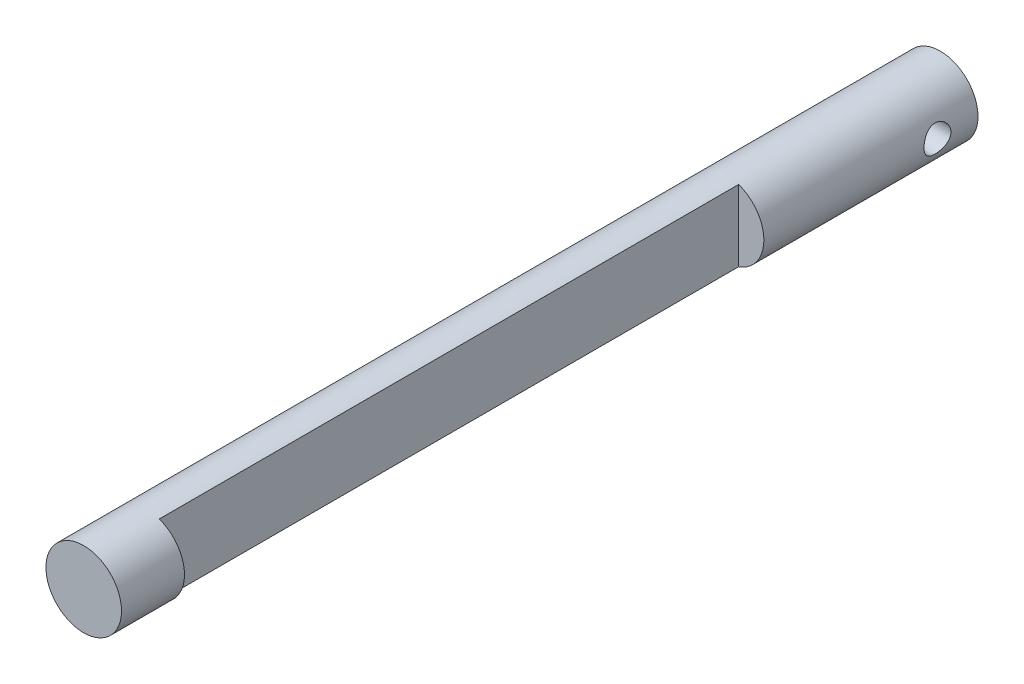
ISO-10303-21;
HEADER;
FILE_DESCRIPTION(('STEP AP214'),'2;1');
FILE_NAME('part.step','',(''),(''),'','','');
FILE_SCHEMA(('AUTOMOTIVE_DESIGN { 1 0 10303 214 1 1 1 1 }'));
ENDSEC;
DATA;
#1=APPLICATION_CONTEXT('core data for automotive mechanical design processes');
#2=APPLICATION_PROTOCOL_DEFINITION('international standard','automotive_design',2000,#1);
#3=PRODUCT_CONTEXT('',#1,'mechanical');
#4=PRODUCT('Part','Part','',(#3));
#5=PRODUCT_RELATED_PRODUCT_CATEGORY('part','',(#4));
#6=PRODUCT_DEFINITION_FORMATION('','',#4);
#7=PRODUCT_DEFINITION_CONTEXT('part definition',#1,'design');
#8=PRODUCT_DEFINITION('design','',#6,#7);
#9=PRODUCT_DEFINITION_SHAPE('','',#8);
#10=(LENGTH_UNIT() NAMED_UNIT(*) SI_UNIT(.MILLI.,.METRE.));
#11=(NAMED_UNIT(*) PLANE_ANGLE_UNIT() SI_UNIT($,.RADIAN.));
#12=(NAMED_UNIT(*) SI_UNIT($,.STERADIAN.) SOLID_ANGLE_UNIT());
#13=UNCERTAINTY_MEASURE_WITH_UNIT(LENGTH_MEASURE(1.E-05),#10,'distance_accuracy_value','');
#14=(GEOMETRIC_REPRESENTATION_CONTEXT(3) GLOBAL_UNCERTAINTY_ASSIGNED_CONTEXT((#13)) GLOBAL_UNIT_ASSIGNED_CONTEXT((#10,
#11,#12)) REPRESENTATION_CONTEXT('',''));
#15=CARTESIAN_POINT('',(0.,0.,0.));
#16=DIRECTION('',(0.,0.,1.));
#17=DIRECTION('',(1.,0.,0.));
#18=AXIS2_PLACEMENT_3D('',#15,#16,#17);
#19=CARTESIAN_POINT('',(0.,0.,17.));
#20=DIRECTION('',(0.,0.,-1.));
#21=DIRECTION('',(-1.,0.,0.));
#22=AXIS2_PLACEMENT_3D('',#19,#20,#21);
#23=CYLINDRICAL_SURFACE('',#22,0.75);
#24=CARTESIAN_POINT('',(-0.75,0.,1.07112854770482));
#25=CARTESIAN_POINT('',(-0.750000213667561,-0.0145385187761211,1.07112884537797));
#26=CARTESIAN_POINT('',(-0.74957348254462,-0.0290749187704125,1.06993973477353));
#27=CARTESIAN_POINT('',(-0.747913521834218,-0.0577160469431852,1.06523181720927));
#28=CARTESIAN_POINT('',(-0.746680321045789,-0.0718207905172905,1.0617130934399));
#29=CARTESIAN_POINT('',(-0.74354053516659,-0.0991815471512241,1.05248436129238));
#30=CARTESIAN_POINT('',(-0.74163517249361,-0.112439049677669,1.04677832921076));
#31=CARTESIAN_POINT('',(-0.737342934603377,-0.13780834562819,1.03335616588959));
#32=CARTESIAN_POINT('',(-0.734955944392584,-0.149919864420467,1.02563955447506));
#33=CARTESIAN_POINT('',(-0.729845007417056,-0.173125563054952,1.0081002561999));
#34=CARTESIAN_POINT('',(-0.727112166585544,-0.184169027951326,0.998213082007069));
#35=CARTESIAN_POINT('',(-0.721663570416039,-0.20448102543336,0.976750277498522));
#36=CARTESIAN_POINT('',(-0.718947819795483,-0.213749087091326,0.965174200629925));
#37=CARTESIAN_POINT('',(-0.713739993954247,-0.230554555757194,0.940184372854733));
#38=CARTESIAN_POINT('',(-0.711258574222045,-0.238022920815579,0.926721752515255));
#39=CARTESIAN_POINT('',(-0.706937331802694,-0.250567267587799,0.898628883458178));
#40=CARTESIAN_POINT('',(-0.705097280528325,-0.255644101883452,0.883999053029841));
#41=CARTESIAN_POINT('',(-0.702361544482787,-0.263065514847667,0.854568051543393));
#42=CARTESIAN_POINT('',(-0.701432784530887,-0.265506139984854,0.839794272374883));
#43=CARTESIAN_POINT('',(-0.700527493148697,-0.267886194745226,0.810019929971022));
#44=CARTESIAN_POINT('',(-0.700550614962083,-0.267826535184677,0.795019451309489));
#45=CARTESIAN_POINT('',(-0.701517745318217,-0.265281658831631,0.766068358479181));
#46=CARTESIAN_POINT('',(-0.702412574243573,-0.262925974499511,0.752104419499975));
#47=CARTESIAN_POINT('',(-0.70494112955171,-0.256068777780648,0.724784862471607));
#48=CARTESIAN_POINT('',(-0.706574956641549,-0.251566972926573,0.711429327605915));
#49=CARTESIAN_POINT('',(-0.710429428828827,-0.240468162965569,0.68542814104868));
#50=CARTESIAN_POINT('',(-0.712659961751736,-0.233835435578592,0.672799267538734));
#51=CARTESIAN_POINT('',(-0.717452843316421,-0.21868789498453,0.648794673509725));
#52=CARTESIAN_POINT('',(-0.720015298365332,-0.210172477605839,0.637419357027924));
#53=CARTESIAN_POINT('',(-0.725372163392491,-0.190895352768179,0.615522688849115));
#54=CARTESIAN_POINT('',(-0.728171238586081,-0.18002908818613,0.60509431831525));
#55=CARTESIAN_POINT('',(-0.733551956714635,-0.156668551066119,0.586181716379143));
#56=CARTESIAN_POINT('',(-0.736133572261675,-0.144174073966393,0.577697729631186));
#57=CARTESIAN_POINT('',(-0.740831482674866,-0.11769277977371,0.562825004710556));
#58=CARTESIAN_POINT('',(-0.742941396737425,-0.103688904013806,0.556464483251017));
#59=CARTESIAN_POINT('',(-0.746411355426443,-0.074716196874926,0.546219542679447));
#60=CARTESIAN_POINT('',(-0.747771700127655,-0.0597477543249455,0.542334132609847));
#61=CARTESIAN_POINT('',(-0.749537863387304,-0.0300554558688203,0.537322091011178));
#62=CARTESIAN_POINT('',(-0.749987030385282,-0.0153553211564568,0.536070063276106));
#63=CARTESIAN_POINT('',(-0.750012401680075,0.0140500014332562,0.535998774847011));
#64=CARTESIAN_POINT('',(-0.749588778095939,0.0287551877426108,0.537179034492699));
#65=CARTESIAN_POINT('',(-0.747944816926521,0.0572294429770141,0.541841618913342));
#66=CARTESIAN_POINT('',(-0.746752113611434,0.071013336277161,0.545244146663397));
#67=CARTESIAN_POINT('',(-0.743717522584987,0.0978068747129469,0.554152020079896));
#68=CARTESIAN_POINT('',(-0.741875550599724,0.110816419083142,0.559657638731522));
#69=CARTESIAN_POINT('',(-0.737662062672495,0.136101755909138,0.572785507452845));
#70=CARTESIAN_POINT('',(-0.735277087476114,0.148346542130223,0.580463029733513));
#71=CARTESIAN_POINT('',(-0.730244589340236,0.171413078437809,0.597653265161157));
#72=CARTESIAN_POINT('',(-0.727596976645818,0.182234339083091,0.607166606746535));
#73=CARTESIAN_POINT('',(-0.722160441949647,0.202738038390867,0.628345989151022));
#74=CARTESIAN_POINT('',(-0.719371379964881,0.212331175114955,0.64009866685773));
#75=CARTESIAN_POINT('',(-0.714104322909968,0.229423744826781,0.665104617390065));
#76=CARTESIAN_POINT('',(-0.711626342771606,0.236923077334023,0.678357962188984));
#77=CARTESIAN_POINT('',(-0.70727974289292,0.249600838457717,0.706046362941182));
#78=CARTESIAN_POINT('',(-0.705411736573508,0.254776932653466,0.720482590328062));
#79=CARTESIAN_POINT('',(-0.70253920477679,0.262595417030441,0.750105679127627));
#80=CARTESIAN_POINT('',(-0.701534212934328,0.265239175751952,0.765292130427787));
#81=CARTESIAN_POINT('',(-0.700559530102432,0.267802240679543,0.795027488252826));
#82=CARTESIAN_POINT('',(-0.700532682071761,0.267871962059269,0.809561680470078));
#83=CARTESIAN_POINT('',(-0.701373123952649,0.265663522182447,0.838422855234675));
#84=CARTESIAN_POINT('',(-0.702240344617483,0.263385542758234,0.852749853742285));
#85=CARTESIAN_POINT('',(-0.704725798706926,0.256658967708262,0.880429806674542));
#86=CARTESIAN_POINT('',(-0.706324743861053,0.252265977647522,0.89379814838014));
#87=CARTESIAN_POINT('',(-0.710084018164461,0.241481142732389,0.919617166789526));
#88=CARTESIAN_POINT('',(-0.712244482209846,0.235088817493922,0.932067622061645));
#89=CARTESIAN_POINT('',(-0.717014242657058,0.220124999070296,0.956354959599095));
#90=CARTESIAN_POINT('',(-0.719640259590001,0.211462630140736,0.96813253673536));
#91=CARTESIAN_POINT('',(-0.724982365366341,0.192351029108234,0.990115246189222));
#92=CARTESIAN_POINT('',(-0.727698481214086,0.181901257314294,1.00031990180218));
#93=CARTESIAN_POINT('',(-0.733068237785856,0.158922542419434,1.01935429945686));
#94=CARTESIAN_POINT('',(-0.73571292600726,0.146318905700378,1.02809675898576));
#95=CARTESIAN_POINT('',(-0.740504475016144,0.119730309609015,1.04333299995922));
#96=CARTESIAN_POINT('',(-0.742651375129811,0.1057454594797,1.04982695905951));
#97=CARTESIAN_POINT('',(-0.74620793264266,0.076731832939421,1.06035471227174));
#98=CARTESIAN_POINT('',(-0.747615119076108,0.0616997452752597,1.06438026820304));
#99=CARTESIAN_POINT('',(-0.749510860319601,0.0311108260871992,1.06976650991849));
#100=CARTESIAN_POINT('',(-0.749999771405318,0.0155542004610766,1.07112822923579));
#101=CARTESIAN_POINT('',(-0.75,0.,1.07112854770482));
#102=B_SPLINE_CURVE_WITH_KNOTS('',3,(#24,#25,#26,#27,#28,#29,#30,#31,#32,#33,#34,#35,#36,#37,
#38,#39,#40,#41,#42,#43,#44,#45,#46,#47,#48,#49,#50,#51,#52,#53,#54,#55,#56,#57,#58,#59,#60,#61,
#62,#63,#64,#65,#66,#67,#68,#69,#70,#71,#72,#73,#74,#75,#76,#77,#78,#79,#80,#81,#82,#83,#84,#85,
#86,#87,#88,#89,#90,#91,#92,#93,#94,#95,#96,#97,#98,#99,#100,#101),.UNSPECIFIED.,.T.,.F.,(4,2,2,
2,2,2,2,2,2,2,2,2,2,2,2,2,2,2,2,2,2,2,2,2,2,2,2,2,2,2,2,2,2,2,2,2,2,2,4),(0.,0.0435582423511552,
0.0871149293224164,0.13059280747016,0.174081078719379,0.219097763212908,0.264126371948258,
0.310676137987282,0.357209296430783,0.401983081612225,0.446740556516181,0.489110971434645,
0.531487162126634,0.574614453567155,0.61775560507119,0.663500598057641,0.709251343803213,
0.755587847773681,0.801905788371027,0.845963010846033,0.890011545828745,0.93255942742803,
0.975112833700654,1.01886533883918,1.06263284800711,1.10869213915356,1.15475364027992,
1.2008613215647,1.24694407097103,1.29032940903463,1.33371138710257,1.37601040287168,
1.41831958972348,1.46268681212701,1.50706745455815,1.55353625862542,1.60000139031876,
1.64662076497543,1.69322204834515),.UNSPECIFIED.);
#103=CARTESIAN_POINT('',(-0.75,0.,1.07112854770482));
#104=VERTEX_POINT('',#103);
#105=EDGE_CURVE('E38',#104,#104,#102,.T.);
#106=ORIENTED_EDGE('',*,*,#105,.T.);
#107=EDGE_LOOP('',(#106));
#108=FACE_BOUND('',#107,.T.);
#109=CARTESIAN_POINT('',(0.75,0.,0.536033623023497));
#110=CARTESIAN_POINT('',(0.750000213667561,-0.0145385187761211,0.536033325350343));
#111=CARTESIAN_POINT('',(0.74957348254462,-0.0290749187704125,0.537222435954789));
#112=CARTESIAN_POINT('',(0.747913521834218,-0.0577160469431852,0.541930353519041));
#113=CARTESIAN_POINT('',(0.746680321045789,-0.0718207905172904,0.545449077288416));
#114=CARTESIAN_POINT('',(0.74354053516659,-0.099181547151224,0.55467780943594));
#115=CARTESIAN_POINT('',(0.74163517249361,-0.112439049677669,0.560383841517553));
#116=CARTESIAN_POINT('',(0.737342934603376,-0.13780834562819,0.573806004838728));
#117=CARTESIAN_POINT('',(0.734955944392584,-0.149919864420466,0.581522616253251));
#118=CARTESIAN_POINT('',(0.729845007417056,-0.173125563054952,0.59906191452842));
#119=CARTESIAN_POINT('',(0.727112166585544,-0.184169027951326,0.608949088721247));
#120=CARTESIAN_POINT('',(0.721663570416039,-0.20448102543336,0.630411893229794));
#121=CARTESIAN_POINT('',(0.718947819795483,-0.213749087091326,0.641987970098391));
#122=CARTESIAN_POINT('',(0.713739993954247,-0.230554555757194,0.666977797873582));
#123=CARTESIAN_POINT('',(0.711258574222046,-0.238022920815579,0.680440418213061));
#124=CARTESIAN_POINT('',(0.706937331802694,-0.250567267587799,0.708533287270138));
#125=CARTESIAN_POINT('',(0.705097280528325,-0.255644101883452,0.723163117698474));
#126=CARTESIAN_POINT('',(0.702361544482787,-0.263065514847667,0.752594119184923));
#127=CARTESIAN_POINT('',(0.701432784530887,-0.265506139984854,0.767367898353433));
#128=CARTESIAN_POINT('',(0.700527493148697,-0.267886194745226,0.797142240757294));
#129=CARTESIAN_POINT('',(0.700550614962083,-0.267826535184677,0.812142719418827));
#130=CARTESIAN_POINT('',(0.701517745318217,-0.265281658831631,0.841093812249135));
#131=CARTESIAN_POINT('',(0.702412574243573,-0.262925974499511,0.855057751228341));
#132=CARTESIAN_POINT('',(0.70494112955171,-0.256068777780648,0.882377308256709));
#133=CARTESIAN_POINT('',(0.706574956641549,-0.251566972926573,0.895732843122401));
#134=CARTESIAN_POINT('',(0.710429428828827,-0.240468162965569,0.921734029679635));
#135=CARTESIAN_POINT('',(0.712659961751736,-0.233835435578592,0.934362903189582));
#136=CARTESIAN_POINT('',(0.717452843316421,-0.21868789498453,0.95836749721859));
#137=CARTESIAN_POINT('',(0.720015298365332,-0.210172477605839,0.969742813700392));
#138=CARTESIAN_POINT('',(0.725372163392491,-0.190895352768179,0.991639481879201));
#139=CARTESIAN_POINT('',(0.728171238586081,-0.18002908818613,1.00206785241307));
#140=CARTESIAN_POINT('',(0.733551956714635,-0.156668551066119,1.02098045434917));
#141=CARTESIAN_POINT('',(0.736133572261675,-0.144174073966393,1.02946444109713));
#142=CARTESIAN_POINT('',(0.740831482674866,-0.11769277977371,1.04433716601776));
#143=CARTESIAN_POINT('',(0.742941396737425,-0.103688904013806,1.0506976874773));
#144=CARTESIAN_POINT('',(0.746411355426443,-0.0747161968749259,1.06094262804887));
#145=CARTESIAN_POINT('',(0.747771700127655,-0.0597477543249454,1.06482803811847));
#146=CARTESIAN_POINT('',(0.749537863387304,-0.0300554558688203,1.06984007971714));
#147=CARTESIAN_POINT('',(0.749987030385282,-0.0153553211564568,1.07109210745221));
#148=CARTESIAN_POINT('',(0.750012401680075,0.0140500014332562,1.0711633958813));
#149=CARTESIAN_POINT('',(0.749588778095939,0.0287551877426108,1.06998313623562));
#150=CARTESIAN_POINT('',(0.747944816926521,0.0572294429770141,1.06532055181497));
#151=CARTESIAN_POINT('',(0.746752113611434,0.0710133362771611,1.06191802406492));
#152=CARTESIAN_POINT('',(0.743717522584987,0.0978068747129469,1.05301015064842));
#153=CARTESIAN_POINT('',(0.741875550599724,0.110816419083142,1.04750453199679));
#154=CARTESIAN_POINT('',(0.737662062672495,0.136101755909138,1.03437666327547));
#155=CARTESIAN_POINT('',(0.735277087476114,0.148346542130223,1.0266991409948));
#156=CARTESIAN_POINT('',(0.730244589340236,0.171413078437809,1.00950890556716));
#157=CARTESIAN_POINT('',(0.727596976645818,0.182234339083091,0.99999556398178));
#158=CARTESIAN_POINT('',(0.722160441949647,0.202738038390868,0.978816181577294));
#159=CARTESIAN_POINT('',(0.719371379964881,0.212331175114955,0.967063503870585));
#160=CARTESIAN_POINT('',(0.714104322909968,0.229423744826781,0.942057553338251));
#161=CARTESIAN_POINT('',(0.711626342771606,0.236923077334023,0.928804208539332));
#162=CARTESIAN_POINT('',(0.70727974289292,0.249600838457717,0.901115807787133));
#163=CARTESIAN_POINT('',(0.705411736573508,0.254776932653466,0.886679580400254));
#164=CARTESIAN_POINT('',(0.70253920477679,0.262595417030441,0.857056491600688));
#165=CARTESIAN_POINT('',(0.701534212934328,0.265239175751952,0.841870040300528));
#166=CARTESIAN_POINT('',(0.700559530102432,0.267802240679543,0.812134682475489));
#167=CARTESIAN_POINT('',(0.700532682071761,0.267871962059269,0.797600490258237));
#168=CARTESIAN_POINT('',(0.701373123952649,0.265663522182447,0.768739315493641));
#169=CARTESIAN_POINT('',(0.702240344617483,0.263385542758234,0.754412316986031));
#170=CARTESIAN_POINT('',(0.704725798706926,0.256658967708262,0.726732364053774));
#171=CARTESIAN_POINT('',(0.706324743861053,0.252265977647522,0.713364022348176));
#172=CARTESIAN_POINT('',(0.710084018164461,0.241481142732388,0.68754500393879));
#173=CARTESIAN_POINT('',(0.712244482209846,0.235088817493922,0.675094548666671));
#174=CARTESIAN_POINT('',(0.717014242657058,0.220124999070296,0.650807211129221));
#175=CARTESIAN_POINT('',(0.71964025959,0.211462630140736,0.639029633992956));
#176=CARTESIAN_POINT('',(0.724982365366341,0.192351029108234,0.617046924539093));
#177=CARTESIAN_POINT('',(0.727698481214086,0.181901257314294,0.606842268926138));
#178=CARTESIAN_POINT('',(0.733068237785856,0.158922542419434,0.587807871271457));
#179=CARTESIAN_POINT('',(0.73571292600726,0.146318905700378,0.579065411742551));
#180=CARTESIAN_POINT('',(0.740504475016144,0.119730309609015,0.563829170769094));
#181=CARTESIAN_POINT('',(0.742651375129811,0.1057454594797,0.557335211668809));
#182=CARTESIAN_POINT('',(0.74620793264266,0.0767318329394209,0.546807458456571));
#183=CARTESIAN_POINT('',(0.747615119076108,0.0616997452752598,0.542781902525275));
#184=CARTESIAN_POINT('',(0.749510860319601,0.0311108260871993,0.537395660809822));
#185=CARTESIAN_POINT('',(0.749999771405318,0.0155542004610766,0.536033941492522));
#186=CARTESIAN_POINT('',(0.75,0.,0.536033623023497));
#187=B_SPLINE_CURVE_WITH_KNOTS('',3,(#109,#110,#111,#112,#113,#114,#115,#116,#117,#118,#119,
#120,#121,#122,#123,#124,#125,#126,#127,#128,#129,#130,#131,#132,#133,#134,#135,#136,#137,#138,
#139,#140,#141,#142,#143,#144,#145,#146,#147,#148,#149,#150,#151,#152,#153,#154,#155,#156,#157,
#158,#159,#160,#161,#162,#163,#164,#165,#166,#167,#168,#169,#170,#171,#172,#173,#174,#175,#176,
#177,#178,#179,#180,#181,#182,#183,#184,#185,#186),.UNSPECIFIED.,.T.,.F.,(4,2,2,2,2,2,2,2,2,2,2,
2,2,2,2,2,2,2,2,2,2,2,2,2,2,2,2,2,2,2,2,2,2,2,2,2,2,2,4),(0.,0.0435582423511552,
0.0871149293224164,0.13059280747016,0.174081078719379,0.219097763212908,0.264126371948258,
0.310676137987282,0.357209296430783,0.401983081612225,0.446740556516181,0.489110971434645,
0.531487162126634,0.574614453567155,0.61775560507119,0.66350059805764,0.709251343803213,
0.755587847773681,0.801905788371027,0.845963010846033,0.890011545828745,0.93255942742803,
0.975112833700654,1.01886533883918,1.06263284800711,1.10869213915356,1.15475364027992,
1.2008613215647,1.24694407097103,1.29032940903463,1.33371138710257,1.37601040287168,
1.41831958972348,1.46268681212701,1.50706745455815,1.55353625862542,1.60000139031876,
1.64662076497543,1.69322204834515),.UNSPECIFIED.);
#188=CARTESIAN_POINT('',(0.75,0.,0.536033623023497));
#189=VERTEX_POINT('',#188);
#190=EDGE_CURVE('E79',#189,#189,#187,.T.);
#191=ORIENTED_EDGE('',*,*,#190,.T.);
#192=EDGE_LOOP('',(#191));
#193=FACE_BOUND('',#192,.T.);
#194=DIRECTION('',(0.,0.,-1.));
#195=VECTOR('',#194,1.);
#196=CARTESIAN_POINT('',(0.250000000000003,-0.707106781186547,17.));
#197=LINE('',#196,#195);
#198=CARTESIAN_POINT('',(0.250000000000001,-0.707106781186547,4.25));
#199=VERTEX_POINT('',#198);
#200=CARTESIAN_POINT('',(0.250000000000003,-0.707106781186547,15.75));
#201=VERTEX_POINT('',#200);
#202=EDGE_CURVE('E70',#199,#201,#197,.F.);
#203=ORIENTED_EDGE('',*,*,#202,.T.);
#204=CARTESIAN_POINT('',(0.,0.,15.75));
#205=DIRECTION('',(0.,0.,1.));
#206=DIRECTION('',(1.,0.,0.));
#207=AXIS2_PLACEMENT_3D('',#204,#205,#206);
#208=CIRCLE('',#207,0.75);
#209=CARTESIAN_POINT('',(0.250000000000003,0.707106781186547,15.75));
#210=VERTEX_POINT('',#209);
#211=EDGE_CURVE('E11',#201,#210,#208,.T.);
#212=ORIENTED_EDGE('',*,*,#211,.T.);
#213=DIRECTION('',(0.,0.,-1.));
#214=VECTOR('',#213,1.);
#215=CARTESIAN_POINT('',(0.250000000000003,0.707106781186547,17.));
#216=LINE('',#215,#214);
#217=CARTESIAN_POINT('',(0.250000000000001,0.707106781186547,4.25));
#218=VERTEX_POINT('',#217);
#219=EDGE_CURVE('E46',#210,#218,#216,.T.);
#220=ORIENTED_EDGE('',*,*,#219,.T.);
#221=CARTESIAN_POINT('',(0.,0.,4.25));
#222=DIRECTION('',(0.,0.,-1.));
#223=DIRECTION('',(-1.,0.,0.));
#224=AXIS2_PLACEMENT_3D('',#221,#222,#223);
#225=CIRCLE('',#224,0.75);
#226=EDGE_CURVE('E66',#218,#199,#225,.T.);
#227=ORIENTED_EDGE('',*,*,#226,.T.);
#228=EDGE_LOOP('',(#203,#212,#220,#227));
#229=FACE_BOUND('',#228,.T.);
#230=CARTESIAN_POINT('',(0.,0.,17.));
#231=DIRECTION('',(0.,0.,1.));
#232=DIRECTION('',(1.,0.,0.));
#233=AXIS2_PLACEMENT_3D('',#230,#231,#232);
#234=CIRCLE('',#233,0.75);
#235=CARTESIAN_POINT('',(0.75,0.,17.));
#236=VERTEX_POINT('',#235);
#237=EDGE_CURVE('E71',#236,#236,#234,.T.);
#238=ORIENTED_EDGE('',*,*,#237,.F.);
#239=EDGE_LOOP('',(#238));
#240=FACE_BOUND('',#239,.T.);
#241=CARTESIAN_POINT('',(0.,0.,0.));
#242=DIRECTION('',(0.,0.,1.));
#243=DIRECTION('',(1.,0.,0.));
#244=AXIS2_PLACEMENT_3D('',#241,#242,#243);
#245=CIRCLE('',#244,0.75);
#246=CARTESIAN_POINT('',(0.75,0.,0.));
#247=VERTEX_POINT('',#246);
#248=EDGE_CURVE('E109',#247,#247,#245,.T.);
#249=ORIENTED_EDGE('',*,*,#248,.T.);
#250=EDGE_LOOP('',(#249));
#251=FACE_BOUND('',#250,.T.);
#252=ADVANCED_FACE('F34',(#108,#193,#229,#240,#251),#23,.T.);
#253=CARTESIAN_POINT('',(0.,0.,17.));
#254=DIRECTION('',(0.,0.,1.));
#255=DIRECTION('',(1.,0.,0.));
#256=AXIS2_PLACEMENT_3D('',#253,#254,#255);
#257=PLANE('',#256);
#258=ORIENTED_EDGE('',*,*,#237,.T.);
#259=EDGE_LOOP('',(#258));
#260=FACE_BOUND('',#259,.T.);
#261=ADVANCED_FACE('F99',(#260),#257,.T.);
#262=CARTESIAN_POINT('',(0.,0.,0.));
#263=DIRECTION('',(0.,0.,1.));
#264=DIRECTION('',(1.,0.,0.));
#265=AXIS2_PLACEMENT_3D('',#262,#263,#264);
#266=PLANE('',#265);
#267=ORIENTED_EDGE('',*,*,#248,.F.);
#268=EDGE_LOOP('',(#267));
#269=FACE_BOUND('',#268,.T.);
#270=ADVANCED_FACE('F92',(#269),#266,.F.);
#271=CARTESIAN_POINT('',(3.37184036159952,-5.,15.75));
#272=DIRECTION('',(0.,0.,1.));
#273=DIRECTION('',(1.,0.,0.));
#274=AXIS2_PLACEMENT_3D('',#271,#272,#273);
#275=PLANE('',#274);
#276=DIRECTION('',(0.,1.,0.));
#277=VECTOR('',#276,1.);
#278=CARTESIAN_POINT('',(0.250000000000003,-5.,15.75));
#279=LINE('',#278,#277);
#280=EDGE_CURVE('E74',#201,#210,#279,.T.);
#281=ORIENTED_EDGE('',*,*,#280,.T.);
#282=ORIENTED_EDGE('',*,*,#211,.F.);
#283=EDGE_LOOP('',(#281,#282));
#284=FACE_BOUND('',#283,.T.);
#285=ADVANCED_FACE('F88',(#284),#275,.F.);
#286=CARTESIAN_POINT('',(0.250000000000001,-5.,4.25));
#287=DIRECTION('',(-1.,0.,0.));
#288=DIRECTION('',(0.,0.,1.));
#289=AXIS2_PLACEMENT_3D('',#286,#287,#288);
#290=PLANE('',#289);
#291=ORIENTED_EDGE('',*,*,#280,.F.);
#292=ORIENTED_EDGE('',*,*,#202,.F.);
#293=DIRECTION('',(0.,1.,0.));
#294=VECTOR('',#293,1.);
#295=CARTESIAN_POINT('',(0.250000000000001,-5.,4.25));
#296=LINE('',#295,#294);
#297=EDGE_CURVE('E53',#199,#218,#296,.T.);
#298=ORIENTED_EDGE('',*,*,#297,.T.);
#299=ORIENTED_EDGE('',*,*,#219,.F.);
#300=EDGE_LOOP('',(#291,#292,#298,#299));
#301=FACE_BOUND('',#300,.T.);
#302=ADVANCED_FACE('F73',(#301),#290,.F.);
#303=CARTESIAN_POINT('',(0.250000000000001,-5.,4.25));
#304=DIRECTION('',(0.,0.,-1.));
#305=DIRECTION('',(-1.,0.,0.));
#306=AXIS2_PLACEMENT_3D('',#303,#304,#305);
#307=PLANE('',#306);
#308=ORIENTED_EDGE('',*,*,#297,.F.);
#309=ORIENTED_EDGE('',*,*,#226,.F.);
#310=EDGE_LOOP('',(#308,#309));
#311=FACE_BOUND('',#310,.T.);
#312=ADVANCED_FACE('F67',(#311),#307,.F.);
#313=CARTESIAN_POINT('',(-1.,0.,0.803581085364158));
#314=DIRECTION('',(1.,0.,0.));
#315=DIRECTION('',(0.,0.,-1.));
#316=AXIS2_PLACEMENT_3D('',#313,#314,#315);
#317=CYLINDRICAL_SURFACE('',#316,0.267547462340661);
#318=ORIENTED_EDGE('',*,*,#190,.F.);
#319=EDGE_LOOP('',(#318));
#320=FACE_BOUND('',#319,.T.);
#321=ORIENTED_EDGE('',*,*,#105,.F.);
#322=EDGE_LOOP('',(#321));
#323=FACE_BOUND('',#322,.T.);
#324=ADVANCED_FACE('F83',(#320,#323),#317,.F.);
#325=CLOSED_SHELL('',(#252,#261,#270,#285,#302,#312,#324));
#326=MANIFOLD_SOLID_BREP('B2',#325);
#327=ADVANCED_BREP_SHAPE_REPRESENTATION('',(#18,#326),#14);
#328=SHAPE_DEFINITION_REPRESENTATION(#9,#327);
ENDSEC;
END-ISO-10303-21;
